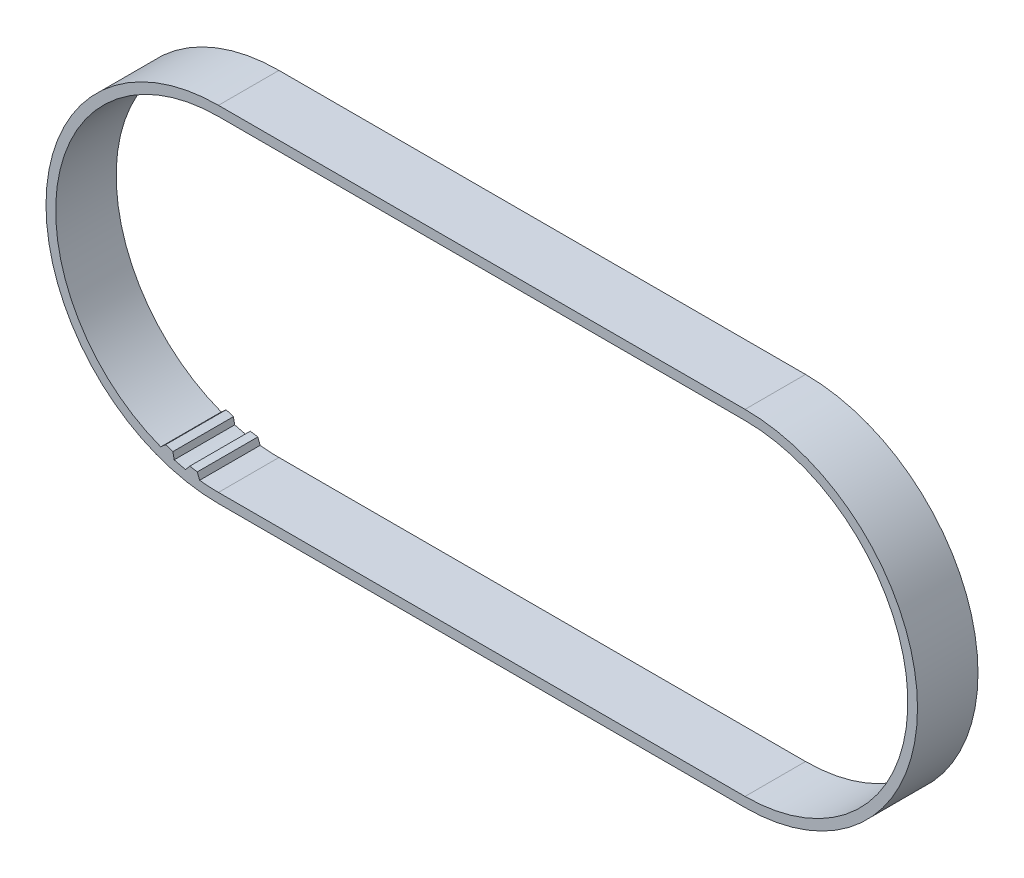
ISO-10303-21;
HEADER;
FILE_DESCRIPTION(('STEP AP214'),'2;1');
FILE_NAME('part.step','',(''),(''),'','','');
FILE_SCHEMA(('AUTOMOTIVE_DESIGN { 1 0 10303 214 1 1 1 1 }'));
ENDSEC;
DATA;
#1=APPLICATION_CONTEXT('core data for automotive mechanical design processes');
#2=APPLICATION_PROTOCOL_DEFINITION('international standard','automotive_design',2000,#1);
#3=PRODUCT_CONTEXT('',#1,'mechanical');
#4=PRODUCT('Part','Part','',(#3));
#5=PRODUCT_RELATED_PRODUCT_CATEGORY('part','',(#4));
#6=PRODUCT_DEFINITION_FORMATION('','',#4);
#7=PRODUCT_DEFINITION_CONTEXT('part definition',#1,'design');
#8=PRODUCT_DEFINITION('design','',#6,#7);
#9=PRODUCT_DEFINITION_SHAPE('','',#8);
#10=(LENGTH_UNIT() NAMED_UNIT(*) SI_UNIT(.MILLI.,.METRE.));
#11=(NAMED_UNIT(*) PLANE_ANGLE_UNIT() SI_UNIT($,.RADIAN.));
#12=(NAMED_UNIT(*) SI_UNIT($,.STERADIAN.) SOLID_ANGLE_UNIT());
#13=UNCERTAINTY_MEASURE_WITH_UNIT(LENGTH_MEASURE(1.E-05),#10,'distance_accuracy_value','');
#14=(GEOMETRIC_REPRESENTATION_CONTEXT(3) GLOBAL_UNCERTAINTY_ASSIGNED_CONTEXT((#13)) GLOBAL_UNIT_ASSIGNED_CONTEXT((#10,
#11,#12)) REPRESENTATION_CONTEXT('',''));
#15=CARTESIAN_POINT('',(0.,0.,0.));
#16=DIRECTION('',(0.,0.,1.));
#17=DIRECTION('',(1.,0.,0.));
#18=AXIS2_PLACEMENT_3D('',#15,#16,#17);
#19=CARTESIAN_POINT('',(-22.9836516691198,-12.1495819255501,2.38125));
#20=DIRECTION('',(-0.775674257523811,0.631133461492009,0.));
#21=DIRECTION('',(-0.631133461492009,-0.775674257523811,0.));
#22=AXIS2_PLACEMENT_3D('',#19,#20,#21);
#23=PLANE('',#22);
#24=DIRECTION('',(-0.631133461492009,-0.775674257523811,0.));
#25=VECTOR('',#24,1.);
#26=CARTESIAN_POINT('',(-22.9836516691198,-12.1495819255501,-2.38125));
#27=LINE('',#26,#25);
#28=CARTESIAN_POINT('',(-22.9836516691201,-12.1495819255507,-2.38125));
#29=VERTEX_POINT('',#28);
#30=CARTESIAN_POINT('',(-23.3100100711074,-12.5506822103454,-2.38125));
#31=VERTEX_POINT('',#30);
#32=EDGE_CURVE('E302',#29,#31,#27,.T.);
#33=ORIENTED_EDGE('',*,*,#32,.T.);
#34=DIRECTION('',(0.,0.,-1.));
#35=VECTOR('',#34,1.);
#36=CARTESIAN_POINT('',(-23.3100100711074,-12.5506822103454,-2.38125));
#37=LINE('',#36,#35);
#38=CARTESIAN_POINT('',(-23.3100100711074,-12.5506822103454,2.38125));
#39=VERTEX_POINT('',#38);
#40=EDGE_CURVE('E330',#31,#39,#37,.F.);
#41=ORIENTED_EDGE('',*,*,#40,.T.);
#42=DIRECTION('',(-0.631133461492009,-0.775674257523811,0.));
#43=VECTOR('',#42,1.);
#44=CARTESIAN_POINT('',(-22.9836516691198,-12.1495819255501,2.38125));
#45=LINE('',#44,#43);
#46=CARTESIAN_POINT('',(-22.9836516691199,-12.1495819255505,2.38125));
#47=VERTEX_POINT('',#46);
#48=EDGE_CURVE('E299',#39,#47,#45,.F.);
#49=ORIENTED_EDGE('',*,*,#48,.T.);
#50=DIRECTION('',(0.,0.,1.));
#51=VECTOR('',#50,1.);
#52=CARTESIAN_POINT('',(-22.98365166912,-12.1495819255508,2.38125));
#53=LINE('',#52,#51);
#54=EDGE_CURVE('E292',#29,#47,#53,.T.);
#55=ORIENTED_EDGE('',*,*,#54,.F.);
#56=EDGE_LOOP('',(#33,#41,#49,#55));
#57=FACE_BOUND('',#56,.T.);
#58=ADVANCED_FACE('F17',(#57),#23,.T.);
#59=CARTESIAN_POINT('',(-20.7264,0.,25.4));
#60=DIRECTION('',(0.,0.,-1.));
#61=DIRECTION('',(-1.,0.,0.));
#62=AXIS2_PLACEMENT_3D('',#59,#60,#61);
#63=CYLINDRICAL_SURFACE('',#62,12.81384661);
#64=ORIENTED_EDGE('',*,*,#40,.F.);
#65=CARTESIAN_POINT('',(-20.7264,0.,-2.38125));
#66=DIRECTION('',(0.,0.,-1.));
#67=DIRECTION('',(-1.,0.,0.));
#68=AXIS2_PLACEMENT_3D('',#65,#66,#67);
#69=CIRCLE('',#68,12.81384661);
#70=CARTESIAN_POINT('',(-24.2087517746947,-12.3315810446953,-2.38125));
#71=VERTEX_POINT('',#70);
#72=EDGE_CURVE('E306',#71,#31,#69,.F.);
#73=ORIENTED_EDGE('',*,*,#72,.F.);
#74=DIRECTION('',(0.,0.,-1.));
#75=VECTOR('',#74,1.);
#76=CARTESIAN_POINT('',(-24.2087517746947,-12.3315810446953,2.38125));
#77=LINE('',#76,#75);
#78=CARTESIAN_POINT('',(-24.2087517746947,-12.3315810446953,2.38125));
#79=VERTEX_POINT('',#78);
#80=EDGE_CURVE('E278',#79,#71,#77,.T.);
#81=ORIENTED_EDGE('',*,*,#80,.F.);
#82=CARTESIAN_POINT('',(-20.7264,0.,2.38125));
#83=DIRECTION('',(0.,0.,-1.));
#84=DIRECTION('',(-1.,0.,0.));
#85=AXIS2_PLACEMENT_3D('',#82,#83,#84);
#86=CIRCLE('',#85,12.81384661);
#87=EDGE_CURVE('E296',#39,#79,#86,.T.);
#88=ORIENTED_EDGE('',*,*,#87,.F.);
#89=EDGE_LOOP('',(#64,#73,#81,#88));
#90=FACE_BOUND('',#89,.T.);
#91=ADVANCED_FACE('F576',(#90),#63,.F.);
#92=CARTESIAN_POINT('',(-22.3912594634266,-12.2448262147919,2.38125));
#93=DIRECTION('',(0.158740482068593,0.987320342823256,0.));
#94=DIRECTION('',(-0.987320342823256,0.158740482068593,0.));
#95=AXIS2_PLACEMENT_3D('',#92,#93,#94);
#96=PLANE('',#95);
#97=ORIENTED_EDGE('',*,*,#54,.T.);
#98=DIRECTION('',(-0.987320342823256,0.158740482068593,0.));
#99=VECTOR('',#98,1.);
#100=CARTESIAN_POINT('',(-22.3912594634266,-12.2448262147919,2.38125));
#101=LINE('',#100,#99);
#102=CARTESIAN_POINT('',(-22.3912594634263,-12.2448262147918,2.38125));
#103=VERTEX_POINT('',#102);
#104=EDGE_CURVE('E287',#47,#103,#101,.F.);
#105=ORIENTED_EDGE('',*,*,#104,.T.);
#106=DIRECTION('',(0.,0.,1.));
#107=VECTOR('',#106,1.);
#108=CARTESIAN_POINT('',(-22.3912594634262,-12.2448262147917,2.38125));
#109=LINE('',#108,#107);
#110=CARTESIAN_POINT('',(-22.3912594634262,-12.2448262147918,-2.38125));
#111=VERTEX_POINT('',#110);
#112=EDGE_CURVE('E274',#111,#103,#109,.T.);
#113=ORIENTED_EDGE('',*,*,#112,.F.);
#114=DIRECTION('',(-0.987320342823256,0.158740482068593,0.));
#115=VECTOR('',#114,1.);
#116=CARTESIAN_POINT('',(-22.3912594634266,-12.2448262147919,-2.38125));
#117=LINE('',#116,#115);
#118=EDGE_CURVE('E293',#111,#29,#117,.T.);
#119=ORIENTED_EDGE('',*,*,#118,.T.);
#120=EDGE_LOOP('',(#97,#105,#113,#119));
#121=FACE_BOUND('',#120,.T.);
#122=ADVANCED_FACE('F568',(#121),#96,.T.);
#123=CARTESIAN_POINT('',(-24.2058921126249,-12.3453506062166,2.38125));
#124=DIRECTION('',(0.979107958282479,0.203341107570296,0.));
#125=DIRECTION('',(-0.203341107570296,0.979107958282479,0.));
#126=AXIS2_PLACEMENT_3D('',#123,#124,#125);
#127=PLANE('',#126);
#128=DIRECTION('',(-0.203341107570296,0.979107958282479,0.));
#129=VECTOR('',#128,1.);
#130=CARTESIAN_POINT('',(-24.2058921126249,-12.3453506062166,2.38125));
#131=LINE('',#130,#129);
#132=CARTESIAN_POINT('',(-24.3138992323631,-11.8252854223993,2.38125));
#133=VERTEX_POINT('',#132);
#134=EDGE_CURVE('E281',#133,#79,#131,.F.);
#135=ORIENTED_EDGE('',*,*,#134,.T.);
#136=ORIENTED_EDGE('',*,*,#80,.T.);
#137=DIRECTION('',(-0.203341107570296,0.979107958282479,0.));
#138=VECTOR('',#137,1.);
#139=CARTESIAN_POINT('',(-24.2058921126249,-12.3453506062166,-2.38125));
#140=LINE('',#139,#138);
#141=CARTESIAN_POINT('',(-24.3138992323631,-11.8252854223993,-2.38125));
#142=VERTEX_POINT('',#141);
#143=EDGE_CURVE('E284',#71,#142,#140,.T.);
#144=ORIENTED_EDGE('',*,*,#143,.T.);
#145=DIRECTION('',(0.,0.,1.));
#146=VECTOR('',#145,1.);
#147=CARTESIAN_POINT('',(-24.3138992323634,-11.8252854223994,2.38125));
#148=LINE('',#147,#146);
#149=EDGE_CURVE('E268',#133,#142,#148,.F.);
#150=ORIENTED_EDGE('',*,*,#149,.F.);
#151=EDGE_LOOP('',(#135,#136,#144,#150));
#152=FACE_BOUND('',#151,.T.);
#153=ADVANCED_FACE('F560',(#152),#127,.T.);
#154=CARTESIAN_POINT('',(-22.2020664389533,-12.7411520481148,2.38125));
#155=DIRECTION('',(0.934414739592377,0.356186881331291,0.));
#156=DIRECTION('',(-0.356186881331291,0.934414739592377,0.));
#157=AXIS2_PLACEMENT_3D('',#154,#155,#156);
#158=PLANE('',#157);
#159=ORIENTED_EDGE('',*,*,#112,.T.);
#160=DIRECTION('',(-0.356186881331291,0.934414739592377,0.));
#161=VECTOR('',#160,1.);
#162=CARTESIAN_POINT('',(-22.2020664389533,-12.7411520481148,2.38125));
#163=LINE('',#162,#161);
#164=CARTESIAN_POINT('',(-22.2070756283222,-12.7280110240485,2.38125));
#165=VERTEX_POINT('',#164);
#166=EDGE_CURVE('E272',#103,#165,#163,.F.);
#167=ORIENTED_EDGE('',*,*,#166,.T.);
#168=DIRECTION('',(0.,0.,-1.));
#169=VECTOR('',#168,1.);
#170=CARTESIAN_POINT('',(-22.2070756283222,-12.7280110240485,2.38125));
#171=LINE('',#170,#169);
#172=CARTESIAN_POINT('',(-22.2070756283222,-12.7280110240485,-2.38125));
#173=VERTEX_POINT('',#172);
#174=EDGE_CURVE('E271',#165,#173,#171,.T.);
#175=ORIENTED_EDGE('',*,*,#174,.T.);
#176=DIRECTION('',(-0.356186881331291,0.934414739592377,0.));
#177=VECTOR('',#176,1.);
#178=CARTESIAN_POINT('',(-22.2020664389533,-12.7411520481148,-2.38125));
#179=LINE('',#178,#177);
#180=EDGE_CURVE('E275',#173,#111,#179,.T.);
#181=ORIENTED_EDGE('',*,*,#180,.T.);
#182=EDGE_LOOP('',(#159,#167,#175,#181));
#183=FACE_BOUND('',#182,.T.);
#184=ADVANCED_FACE('F552',(#183),#158,.T.);
#185=CARTESIAN_POINT('',(-24.3138992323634,-11.8252854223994,2.38125));
#186=DIRECTION('',(0.313455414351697,0.94960291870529,0.));
#187=DIRECTION('',(-0.94960291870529,0.313455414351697,0.));
#188=AXIS2_PLACEMENT_3D('',#185,#186,#187);
#189=PLANE('',#188);
#190=DIRECTION('',(0.,0.,1.));
#191=VECTOR('',#190,1.);
#192=CARTESIAN_POINT('',(-24.8836609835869,-11.6372121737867,2.38125));
#193=LINE('',#192,#191);
#194=CARTESIAN_POINT('',(-24.883660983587,-11.6372121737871,2.38125));
#195=VERTEX_POINT('',#194);
#196=CARTESIAN_POINT('',(-24.883660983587,-11.6372121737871,-2.38125));
#197=VERTEX_POINT('',#196);
#198=EDGE_CURVE('E257',#195,#197,#193,.F.);
#199=ORIENTED_EDGE('',*,*,#198,.F.);
#200=DIRECTION('',(-0.94960291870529,0.313455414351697,0.));
#201=VECTOR('',#200,1.);
#202=CARTESIAN_POINT('',(-24.3138992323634,-11.8252854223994,2.38125));
#203=LINE('',#202,#201);
#204=EDGE_CURVE('E267',#195,#133,#203,.F.);
#205=ORIENTED_EDGE('',*,*,#204,.T.);
#206=ORIENTED_EDGE('',*,*,#149,.T.);
#207=DIRECTION('',(-0.94960291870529,0.313455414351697,0.));
#208=VECTOR('',#207,1.);
#209=CARTESIAN_POINT('',(-24.3138992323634,-11.8252854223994,-2.38125));
#210=LINE('',#209,#208);
#211=EDGE_CURVE('E264',#142,#197,#210,.T.);
#212=ORIENTED_EDGE('',*,*,#211,.T.);
#213=EDGE_LOOP('',(#199,#205,#206,#212));
#214=FACE_BOUND('',#213,.T.);
#215=ADVANCED_FACE('F544',(#214),#189,.T.);
#216=CARTESIAN_POINT('',(-20.7264,0.,25.4));
#217=DIRECTION('',(0.,0.,-1.));
#218=DIRECTION('',(-1.,0.,0.));
#219=AXIS2_PLACEMENT_3D('',#216,#217,#218);
#220=CYLINDRICAL_SURFACE('',#219,12.81384661);
#221=DIRECTION('',(0.,0.,1.));
#222=VECTOR('',#221,1.);
#223=CARTESIAN_POINT('',(-20.7264,-12.81384661,2.38125));
#224=LINE('',#223,#222);
#225=CARTESIAN_POINT('',(-20.7264,-12.81384661,-2.38125));
#226=VERTEX_POINT('',#225);
#227=CARTESIAN_POINT('',(-20.7264,-12.81384661,2.38125));
#228=VERTEX_POINT('',#227);
#229=EDGE_CURVE('E251',#226,#228,#224,.T.);
#230=ORIENTED_EDGE('',*,*,#229,.F.);
#231=CARTESIAN_POINT('',(-20.7264,0.,-2.38125));
#232=DIRECTION('',(0.,0.,-1.));
#233=DIRECTION('',(-1.,0.,0.));
#234=AXIS2_PLACEMENT_3D('',#231,#232,#233);
#235=CIRCLE('',#234,12.81384661);
#236=EDGE_CURVE('E323',#173,#226,#235,.F.);
#237=ORIENTED_EDGE('',*,*,#236,.F.);
#238=ORIENTED_EDGE('',*,*,#174,.F.);
#239=CARTESIAN_POINT('',(-20.7264,0.,2.38125));
#240=DIRECTION('',(0.,0.,-1.));
#241=DIRECTION('',(-1.,0.,0.));
#242=AXIS2_PLACEMENT_3D('',#239,#240,#241);
#243=CIRCLE('',#242,12.81384661);
#244=EDGE_CURVE('E261',#228,#165,#243,.T.);
#245=ORIENTED_EDGE('',*,*,#244,.F.);
#246=EDGE_LOOP('',(#230,#237,#238,#245));
#247=FACE_BOUND('',#246,.T.);
#248=ADVANCED_FACE('F536',(#247),#220,.F.);
#249=CARTESIAN_POINT('',(-24.8836609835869,-11.6372121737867,2.38125));
#250=DIRECTION('',(-0.665652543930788,0.746261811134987,0.));
#251=DIRECTION('',(-0.746261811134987,-0.665652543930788,0.));
#252=AXIS2_PLACEMENT_3D('',#249,#250,#251);
#253=PLANE('',#252);
#254=DIRECTION('',(-0.746261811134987,-0.665652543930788,0.));
#255=VECTOR('',#254,1.);
#256=CARTESIAN_POINT('',(-24.8836609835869,-11.6372121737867,-2.38125));
#257=LINE('',#256,#255);
#258=CARTESIAN_POINT('',(-25.2695519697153,-11.9814204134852,-2.38125));
#259=VERTEX_POINT('',#258);
#260=EDGE_CURVE('E254',#197,#259,#257,.T.);
#261=ORIENTED_EDGE('',*,*,#260,.T.);
#262=DIRECTION('',(0.,0.,-1.));
#263=VECTOR('',#262,1.);
#264=CARTESIAN_POINT('',(-25.2695518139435,-11.9814204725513,25.4));
#265=LINE('',#264,#263);
#266=CARTESIAN_POINT('',(-25.2695519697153,-11.9814204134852,2.38125));
#267=VERTEX_POINT('',#266);
#268=EDGE_CURVE('E244',#259,#267,#265,.F.);
#269=ORIENTED_EDGE('',*,*,#268,.T.);
#270=DIRECTION('',(-0.746261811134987,-0.665652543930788,0.));
#271=VECTOR('',#270,1.);
#272=CARTESIAN_POINT('',(-24.8836609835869,-11.6372121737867,2.38125));
#273=LINE('',#272,#271);
#274=EDGE_CURVE('E258',#267,#195,#273,.F.);
#275=ORIENTED_EDGE('',*,*,#274,.T.);
#276=ORIENTED_EDGE('',*,*,#198,.T.);
#277=EDGE_LOOP('',(#261,#269,#275,#276));
#278=FACE_BOUND('',#277,.T.);
#279=ADVANCED_FACE('F528',(#278),#253,.T.);
#280=CARTESIAN_POINT('',(20.7264,-12.81384661,2.38125));
#281=DIRECTION('',(0.,1.,0.));
#282=DIRECTION('',(0.,0.,1.));
#283=AXIS2_PLACEMENT_3D('',#280,#281,#282);
#284=PLANE('',#283);
#285=DIRECTION('',(1.,0.,0.));
#286=VECTOR('',#285,1.);
#287=CARTESIAN_POINT('',(-20.7264,-12.81384661,2.38125));
#288=LINE('',#287,#286);
#289=CARTESIAN_POINT('',(20.7264,-12.81384661,2.38125));
#290=VERTEX_POINT('',#289);
#291=EDGE_CURVE('E230',#290,#228,#288,.F.);
#292=ORIENTED_EDGE('',*,*,#291,.F.);
#293=DIRECTION('',(0.,0.,-1.));
#294=VECTOR('',#293,1.);
#295=CARTESIAN_POINT('',(20.7264,-12.81384661,25.4));
#296=LINE('',#295,#294);
#297=CARTESIAN_POINT('',(20.7264,-12.81384661,-2.38125));
#298=VERTEX_POINT('',#297);
#299=EDGE_CURVE('E249',#290,#298,#296,.T.);
#300=ORIENTED_EDGE('',*,*,#299,.T.);
#301=DIRECTION('',(-1.,0.,0.));
#302=VECTOR('',#301,1.);
#303=CARTESIAN_POINT('',(-20.7264,-12.81384661,-2.38125));
#304=LINE('',#303,#302);
#305=EDGE_CURVE('E211',#226,#298,#304,.F.);
#306=ORIENTED_EDGE('',*,*,#305,.F.);
#307=ORIENTED_EDGE('',*,*,#229,.T.);
#308=EDGE_LOOP('',(#292,#300,#306,#307));
#309=FACE_BOUND('',#308,.T.);
#310=ADVANCED_FACE('F520',(#309),#284,.T.);
#311=CARTESIAN_POINT('',(20.7264,0.,25.4));
#312=DIRECTION('',(0.,0.,-1.));
#313=DIRECTION('',(-1.,0.,0.));
#314=AXIS2_PLACEMENT_3D('',#311,#312,#313);
#315=CYLINDRICAL_SURFACE('',#314,12.81384661);
#316=ORIENTED_EDGE('',*,*,#299,.F.);
#317=CARTESIAN_POINT('',(20.7264,0.,2.38125));
#318=DIRECTION('',(0.,0.,-1.));
#319=DIRECTION('',(-1.,0.,0.));
#320=AXIS2_PLACEMENT_3D('',#317,#318,#319);
#321=CIRCLE('',#320,12.81384661);
#322=CARTESIAN_POINT('',(20.7264,12.81384661,2.38125));
#323=VERTEX_POINT('',#322);
#324=EDGE_CURVE('E233',#323,#290,#321,.T.);
#325=ORIENTED_EDGE('',*,*,#324,.F.);
#326=DIRECTION('',(0.,0.,-1.));
#327=VECTOR('',#326,1.);
#328=CARTESIAN_POINT('',(20.7264,12.81384661,2.38125));
#329=LINE('',#328,#327);
#330=CARTESIAN_POINT('',(20.7264,12.81384661,-2.38125));
#331=VERTEX_POINT('',#330);
#332=EDGE_CURVE('E247',#331,#323,#329,.F.);
#333=ORIENTED_EDGE('',*,*,#332,.F.);
#334=CARTESIAN_POINT('',(20.7264,0.,-2.38125));
#335=DIRECTION('',(0.,0.,-1.));
#336=DIRECTION('',(-1.,0.,0.));
#337=AXIS2_PLACEMENT_3D('',#334,#335,#336);
#338=CIRCLE('',#337,12.81384661);
#339=EDGE_CURVE('E210',#298,#331,#338,.F.);
#340=ORIENTED_EDGE('',*,*,#339,.F.);
#341=EDGE_LOOP('',(#316,#325,#333,#340));
#342=FACE_BOUND('',#341,.T.);
#343=ADVANCED_FACE('F512',(#342),#315,.F.);
#344=CARTESIAN_POINT('',(-20.7264,12.81384661,2.38125));
#345=DIRECTION('',(0.,-1.,0.));
#346=DIRECTION('',(0.,0.,-1.));
#347=AXIS2_PLACEMENT_3D('',#344,#345,#346);
#348=PLANE('',#347);
#349=DIRECTION('',(1.,0.,0.));
#350=VECTOR('',#349,1.);
#351=CARTESIAN_POINT('',(-20.7264,12.81384661,2.38125));
#352=LINE('',#351,#350);
#353=CARTESIAN_POINT('',(-20.7264,12.81384661,2.38125));
#354=VERTEX_POINT('',#353);
#355=EDGE_CURVE('E234',#354,#323,#352,.T.);
#356=ORIENTED_EDGE('',*,*,#355,.F.);
#357=DIRECTION('',(0.,0.,-1.));
#358=VECTOR('',#357,1.);
#359=CARTESIAN_POINT('',(-20.7264,12.81384661,25.4));
#360=LINE('',#359,#358);
#361=CARTESIAN_POINT('',(-20.7264,12.81384661,-2.38125));
#362=VERTEX_POINT('',#361);
#363=EDGE_CURVE('E242',#354,#362,#360,.T.);
#364=ORIENTED_EDGE('',*,*,#363,.T.);
#365=DIRECTION('',(-1.,0.,0.));
#366=VECTOR('',#365,1.);
#367=CARTESIAN_POINT('',(-20.7264,12.81384661,-2.38125));
#368=LINE('',#367,#366);
#369=EDGE_CURVE('E206',#331,#362,#368,.T.);
#370=ORIENTED_EDGE('',*,*,#369,.F.);
#371=ORIENTED_EDGE('',*,*,#332,.T.);
#372=EDGE_LOOP('',(#356,#364,#370,#371));
#373=FACE_BOUND('',#372,.T.);
#374=ADVANCED_FACE('F504',(#373),#348,.T.);
#375=CARTESIAN_POINT('',(-20.7264,0.,25.4));
#376=DIRECTION('',(0.,0.,-1.));
#377=DIRECTION('',(-1.,0.,0.));
#378=AXIS2_PLACEMENT_3D('',#375,#376,#377);
#379=CYLINDRICAL_SURFACE('',#378,12.81384661);
#380=ORIENTED_EDGE('',*,*,#363,.F.);
#381=CARTESIAN_POINT('',(-20.7264,0.,2.38125));
#382=DIRECTION('',(0.,0.,-1.));
#383=DIRECTION('',(-1.,0.,0.));
#384=AXIS2_PLACEMENT_3D('',#381,#382,#383);
#385=CIRCLE('',#384,12.81384661);
#386=EDGE_CURVE('E229',#267,#354,#385,.T.);
#387=ORIENTED_EDGE('',*,*,#386,.F.);
#388=ORIENTED_EDGE('',*,*,#268,.F.);
#389=CARTESIAN_POINT('',(-20.7264,0.,-2.38125));
#390=DIRECTION('',(0.,0.,-1.));
#391=DIRECTION('',(-1.,0.,0.));
#392=AXIS2_PLACEMENT_3D('',#389,#390,#391);
#393=CIRCLE('',#392,12.81384661);
#394=EDGE_CURVE('E209',#362,#259,#393,.F.);
#395=ORIENTED_EDGE('',*,*,#394,.F.);
#396=EDGE_LOOP('',(#380,#387,#388,#395));
#397=FACE_BOUND('',#396,.T.);
#398=ADVANCED_FACE('F496',(#397),#379,.F.);
#399=CARTESIAN_POINT('',(20.7264,0.,25.4));
#400=DIRECTION('',(0.,0.,-1.));
#401=DIRECTION('',(-1.,0.,0.));
#402=AXIS2_PLACEMENT_3D('',#399,#400,#401);
#403=CYLINDRICAL_SURFACE('',#402,13.57584661);
#404=CARTESIAN_POINT('',(20.7264,0.,-2.38125));
#405=DIRECTION('',(0.,0.,-1.));
#406=DIRECTION('',(-1.,0.,0.));
#407=AXIS2_PLACEMENT_3D('',#404,#405,#406);
#408=CIRCLE('',#407,13.57584661);
#409=CARTESIAN_POINT('',(20.7264,13.57584661,-2.38125));
#410=VERTEX_POINT('',#409);
#411=CARTESIAN_POINT('',(20.7264,-13.57584661,-2.38125));
#412=VERTEX_POINT('',#411);
#413=EDGE_CURVE('E214',#410,#412,#408,.T.);
#414=ORIENTED_EDGE('',*,*,#413,.F.);
#415=DIRECTION('',(0.,0.,1.));
#416=VECTOR('',#415,1.);
#417=CARTESIAN_POINT('',(20.7264,13.57584661,-2.38125));
#418=LINE('',#417,#416);
#419=CARTESIAN_POINT('',(20.7264,13.57584661,2.38125));
#420=VERTEX_POINT('',#419);
#421=EDGE_CURVE('E218',#420,#410,#418,.F.);
#422=ORIENTED_EDGE('',*,*,#421,.F.);
#423=CARTESIAN_POINT('',(20.7264,0.,2.38125));
#424=DIRECTION('',(0.,0.,-1.));
#425=DIRECTION('',(-1.,0.,0.));
#426=AXIS2_PLACEMENT_3D('',#423,#424,#425);
#427=CIRCLE('',#426,13.57584661);
#428=CARTESIAN_POINT('',(20.7264,-13.57584661,2.38125));
#429=VERTEX_POINT('',#428);
#430=EDGE_CURVE('E237',#429,#420,#427,.F.);
#431=ORIENTED_EDGE('',*,*,#430,.F.);
#432=DIRECTION('',(0.,0.,-1.));
#433=VECTOR('',#432,1.);
#434=CARTESIAN_POINT('',(20.7264,-13.57584661,-2.38125));
#435=LINE('',#434,#433);
#436=EDGE_CURVE('E224',#412,#429,#435,.F.);
#437=ORIENTED_EDGE('',*,*,#436,.F.);
#438=EDGE_LOOP('',(#414,#422,#431,#437));
#439=FACE_BOUND('',#438,.T.);
#440=ADVANCED_FACE('F488',(#439),#403,.T.);
#441=CARTESIAN_POINT('',(-20.7264,13.57584661,2.38125));
#442=DIRECTION('',(0.,0.,1.));
#443=DIRECTION('',(1.,0.,0.));
#444=AXIS2_PLACEMENT_3D('',#441,#442,#443);
#445=PLANE('',#444);
#446=ORIENTED_EDGE('',*,*,#274,.F.);
#447=ORIENTED_EDGE('',*,*,#386,.T.);
#448=ORIENTED_EDGE('',*,*,#355,.T.);
#449=ORIENTED_EDGE('',*,*,#324,.T.);
#450=ORIENTED_EDGE('',*,*,#291,.T.);
#451=ORIENTED_EDGE('',*,*,#244,.T.);
#452=ORIENTED_EDGE('',*,*,#166,.F.);
#453=ORIENTED_EDGE('',*,*,#104,.F.);
#454=ORIENTED_EDGE('',*,*,#48,.F.);
#455=ORIENTED_EDGE('',*,*,#87,.T.);
#456=ORIENTED_EDGE('',*,*,#134,.F.);
#457=ORIENTED_EDGE('',*,*,#204,.F.);
#458=EDGE_LOOP('',(#446,#447,#448,#449,#450,#451,#452,#453,#454,#455,#456,#457));
#459=FACE_BOUND('',#458,.T.);
#460=ORIENTED_EDGE('',*,*,#430,.T.);
#461=DIRECTION('',(1.,0.,0.));
#462=VECTOR('',#461,1.);
#463=CARTESIAN_POINT('',(-20.7264,13.57584661,2.38125));
#464=LINE('',#463,#462);
#465=CARTESIAN_POINT('',(-20.7264,13.57584661,2.38125));
#466=VERTEX_POINT('',#465);
#467=EDGE_CURVE('E226',#466,#420,#464,.T.);
#468=ORIENTED_EDGE('',*,*,#467,.F.);
#469=CARTESIAN_POINT('',(-20.7264,0.,2.38125));
#470=DIRECTION('',(0.,0.,-1.));
#471=DIRECTION('',(-1.,0.,0.));
#472=AXIS2_PLACEMENT_3D('',#469,#470,#471);
#473=CIRCLE('',#472,13.57584661);
#474=CARTESIAN_POINT('',(-20.7264,-13.57584661,2.38125));
#475=VERTEX_POINT('',#474);
#476=EDGE_CURVE('E221',#475,#466,#473,.T.);
#477=ORIENTED_EDGE('',*,*,#476,.F.);
#478=DIRECTION('',(1.,0.,0.));
#479=VECTOR('',#478,1.);
#480=CARTESIAN_POINT('',(20.7264,-13.57584661,2.38125));
#481=LINE('',#480,#479);
#482=EDGE_CURVE('E225',#429,#475,#481,.F.);
#483=ORIENTED_EDGE('',*,*,#482,.F.);
#484=EDGE_LOOP('',(#460,#468,#477,#483));
#485=FACE_BOUND('',#484,.T.);
#486=ADVANCED_FACE('F480',(#459,#485),#445,.T.);
#487=CARTESIAN_POINT('',(-20.7264,13.57584661,-2.38125));
#488=DIRECTION('',(0.,1.,0.));
#489=DIRECTION('',(0.,0.,1.));
#490=AXIS2_PLACEMENT_3D('',#487,#488,#489);
#491=PLANE('',#490);
#492=DIRECTION('',(-1.,0.,0.));
#493=VECTOR('',#492,1.);
#494=CARTESIAN_POINT('',(-20.7264,13.57584661,-2.38125));
#495=LINE('',#494,#493);
#496=CARTESIAN_POINT('',(-20.7264,13.57584661,-2.38125));
#497=VERTEX_POINT('',#496);
#498=EDGE_CURVE('E215',#497,#410,#495,.F.);
#499=ORIENTED_EDGE('',*,*,#498,.F.);
#500=DIRECTION('',(0.,0.,-1.));
#501=VECTOR('',#500,1.);
#502=CARTESIAN_POINT('',(-20.7264,13.57584661,25.4));
#503=LINE('',#502,#501);
#504=EDGE_CURVE('E219',#466,#497,#503,.T.);
#505=ORIENTED_EDGE('',*,*,#504,.F.);
#506=ORIENTED_EDGE('',*,*,#467,.T.);
#507=ORIENTED_EDGE('',*,*,#421,.T.);
#508=EDGE_LOOP('',(#499,#505,#506,#507));
#509=FACE_BOUND('',#508,.T.);
#510=ADVANCED_FACE('F472',(#509),#491,.T.);
#511=CARTESIAN_POINT('',(-20.7264,12.81384661,-2.38125));
#512=DIRECTION('',(0.,0.,-1.));
#513=DIRECTION('',(-1.,0.,0.));
#514=AXIS2_PLACEMENT_3D('',#511,#512,#513);
#515=PLANE('',#514);
#516=ORIENTED_EDGE('',*,*,#143,.F.);
#517=ORIENTED_EDGE('',*,*,#72,.T.);
#518=ORIENTED_EDGE('',*,*,#32,.F.);
#519=ORIENTED_EDGE('',*,*,#118,.F.);
#520=ORIENTED_EDGE('',*,*,#180,.F.);
#521=ORIENTED_EDGE('',*,*,#236,.T.);
#522=ORIENTED_EDGE('',*,*,#305,.T.);
#523=ORIENTED_EDGE('',*,*,#339,.T.);
#524=ORIENTED_EDGE('',*,*,#369,.T.);
#525=ORIENTED_EDGE('',*,*,#394,.T.);
#526=ORIENTED_EDGE('',*,*,#260,.F.);
#527=ORIENTED_EDGE('',*,*,#211,.F.);
#528=EDGE_LOOP('',(#516,#517,#518,#519,#520,#521,#522,#523,#524,#525,#526,#527));
#529=FACE_BOUND('',#528,.T.);
#530=DIRECTION('',(1.,0.,0.));
#531=VECTOR('',#530,1.);
#532=CARTESIAN_POINT('',(20.7264,-13.57584661,-2.38125));
#533=LINE('',#532,#531);
#534=CARTESIAN_POINT('',(-20.7264,-13.57584661,-2.38125));
#535=VERTEX_POINT('',#534);
#536=EDGE_CURVE('E35',#535,#412,#533,.T.);
#537=ORIENTED_EDGE('',*,*,#536,.F.);
#538=CARTESIAN_POINT('',(-20.7264,0.,-2.38125));
#539=DIRECTION('',(0.,0.,-1.));
#540=DIRECTION('',(-1.,0.,0.));
#541=AXIS2_PLACEMENT_3D('',#538,#539,#540);
#542=CIRCLE('',#541,13.57584661);
#543=EDGE_CURVE('E26',#497,#535,#542,.F.);
#544=ORIENTED_EDGE('',*,*,#543,.F.);
#545=ORIENTED_EDGE('',*,*,#498,.T.);
#546=ORIENTED_EDGE('',*,*,#413,.T.);
#547=EDGE_LOOP('',(#537,#544,#545,#546));
#548=FACE_BOUND('',#547,.T.);
#549=ADVANCED_FACE('F464',(#529,#548),#515,.T.);
#550=CARTESIAN_POINT('',(20.7264,-13.57584661,-2.38125));
#551=DIRECTION('',(0.,-1.,0.));
#552=DIRECTION('',(0.,0.,-1.));
#553=AXIS2_PLACEMENT_3D('',#550,#551,#552);
#554=PLANE('',#553);
#555=ORIENTED_EDGE('',*,*,#536,.T.);
#556=ORIENTED_EDGE('',*,*,#436,.T.);
#557=ORIENTED_EDGE('',*,*,#482,.T.);
#558=DIRECTION('',(0.,0.,-1.));
#559=VECTOR('',#558,1.);
#560=CARTESIAN_POINT('',(-20.7264,-13.57584661,25.4));
#561=LINE('',#560,#559);
#562=EDGE_CURVE('E10',#535,#475,#561,.F.);
#563=ORIENTED_EDGE('',*,*,#562,.F.);
#564=EDGE_LOOP('',(#555,#556,#557,#563));
#565=FACE_BOUND('',#564,.T.);
#566=ADVANCED_FACE('F456',(#565),#554,.T.);
#567=CARTESIAN_POINT('',(-20.7264,0.,25.4));
#568=DIRECTION('',(0.,0.,-1.));
#569=DIRECTION('',(-1.,0.,0.));
#570=AXIS2_PLACEMENT_3D('',#567,#568,#569);
#571=CYLINDRICAL_SURFACE('',#570,13.57584661);
#572=ORIENTED_EDGE('',*,*,#543,.T.);
#573=ORIENTED_EDGE('',*,*,#562,.T.);
#574=ORIENTED_EDGE('',*,*,#476,.T.);
#575=ORIENTED_EDGE('',*,*,#504,.T.);
#576=EDGE_LOOP('',(#572,#573,#574,#575));
#577=FACE_BOUND('',#576,.T.);
#578=ADVANCED_FACE('F452',(#577),#571,.T.);
#579=CLOSED_SHELL('',(#58,#91,#122,#153,#184,#215,#248,#279,#310,#343,#374,#398,#440,#486,#510,
#549,#566,#578));
#580=CARTESIAN_POINT('',(-20.7264,0.,25.4));
#581=DIRECTION('',(0.,0.,-1.));
#582=DIRECTION('',(-1.,0.,0.));
#583=AXIS2_PLACEMENT_3D('',#580,#581,#582);
#584=CYLINDRICAL_SURFACE('',#583,12.83924661);
#585=DIRECTION('',(0.,0.,1.));
#586=VECTOR('',#585,1.);
#587=CARTESIAN_POINT('',(-20.7264,12.83924661,-2.35585));
#588=LINE('',#587,#586);
#589=CARTESIAN_POINT('',(-20.7264,12.83924661,-2.35585));
#590=VERTEX_POINT('',#589);
#591=CARTESIAN_POINT('',(-20.7264,12.83924661,2.35585));
#592=VERTEX_POINT('',#591);
#593=EDGE_CURVE('E204',#590,#592,#588,.T.);
#594=ORIENTED_EDGE('',*,*,#593,.F.);
#595=CARTESIAN_POINT('',(-20.7264,0.,-2.35585));
#596=DIRECTION('',(0.,0.,-1.));
#597=DIRECTION('',(-1.,0.,0.));
#598=AXIS2_PLACEMENT_3D('',#595,#596,#597);
#599=CIRCLE('',#598,12.83924661);
#600=CARTESIAN_POINT('',(-20.7264,-12.83924661,-2.35585));
#601=VERTEX_POINT('',#600);
#602=EDGE_CURVE('E342',#601,#590,#599,.T.);
#603=ORIENTED_EDGE('',*,*,#602,.F.);
#604=DIRECTION('',(0.,0.,-1.));
#605=VECTOR('',#604,1.);
#606=CARTESIAN_POINT('',(-20.7264,-12.83924661,-2.35585));
#607=LINE('',#606,#605);
#608=CARTESIAN_POINT('',(-20.7264,-12.83924661,2.35585));
#609=VERTEX_POINT('',#608);
#610=EDGE_CURVE('E178',#609,#601,#607,.T.);
#611=ORIENTED_EDGE('',*,*,#610,.F.);
#612=CARTESIAN_POINT('',(-20.7264,0.,2.35585));
#613=DIRECTION('',(0.,0.,-1.));
#614=DIRECTION('',(-1.,0.,0.));
#615=AXIS2_PLACEMENT_3D('',#612,#613,#614);
#616=CIRCLE('',#615,12.83924661);
#617=EDGE_CURVE('E192',#592,#609,#616,.F.);
#618=ORIENTED_EDGE('',*,*,#617,.F.);
#619=EDGE_LOOP('',(#594,#603,#611,#618));
#620=FACE_BOUND('',#619,.T.);
#621=ADVANCED_FACE('F355',(#620),#584,.T.);
#622=CARTESIAN_POINT('',(-20.7264,12.83924661,-2.35585));
#623=DIRECTION('',(0.,1.,0.));
#624=DIRECTION('',(0.,0.,1.));
#625=AXIS2_PLACEMENT_3D('',#622,#623,#624);
#626=PLANE('',#625);
#627=DIRECTION('',(0.,0.,-1.));
#628=VECTOR('',#627,1.);
#629=CARTESIAN_POINT('',(20.7264,12.83924661,25.4));
#630=LINE('',#629,#628);
#631=CARTESIAN_POINT('',(20.7264,12.83924661,-2.35585));
#632=VERTEX_POINT('',#631);
#633=CARTESIAN_POINT('',(20.7264,12.83924661,2.35585));
#634=VERTEX_POINT('',#633);
#635=EDGE_CURVE('E201',#632,#634,#630,.F.);
#636=ORIENTED_EDGE('',*,*,#635,.F.);
#637=DIRECTION('',(1.,0.,0.));
#638=VECTOR('',#637,1.);
#639=CARTESIAN_POINT('',(-20.7264,12.83924661,-2.35585));
#640=LINE('',#639,#638);
#641=EDGE_CURVE('E341',#590,#632,#640,.T.);
#642=ORIENTED_EDGE('',*,*,#641,.F.);
#643=ORIENTED_EDGE('',*,*,#593,.T.);
#644=DIRECTION('',(-1.,0.,0.));
#645=VECTOR('',#644,1.);
#646=CARTESIAN_POINT('',(-20.7264,12.83924661,2.35585));
#647=LINE('',#646,#645);
#648=EDGE_CURVE('E177',#634,#592,#647,.T.);
#649=ORIENTED_EDGE('',*,*,#648,.F.);
#650=EDGE_LOOP('',(#636,#642,#643,#649));
#651=FACE_BOUND('',#650,.T.);
#652=ADVANCED_FACE('F366',(#651),#626,.T.);
#653=CARTESIAN_POINT('',(20.7264,0.,25.4));
#654=DIRECTION('',(0.,0.,-1.));
#655=DIRECTION('',(-1.,0.,0.));
#656=AXIS2_PLACEMENT_3D('',#653,#654,#655);
#657=CYLINDRICAL_SURFACE('',#656,12.83924661);
#658=DIRECTION('',(0.,0.,-1.));
#659=VECTOR('',#658,1.);
#660=CARTESIAN_POINT('',(20.7264,-12.83924661,-2.35585));
#661=LINE('',#660,#659);
#662=CARTESIAN_POINT('',(20.7264,-12.83924661,-2.35585));
#663=VERTEX_POINT('',#662);
#664=CARTESIAN_POINT('',(20.7264,-12.83924661,2.35585));
#665=VERTEX_POINT('',#664);
#666=EDGE_CURVE('E199',#663,#665,#661,.F.);
#667=ORIENTED_EDGE('',*,*,#666,.F.);
#668=CARTESIAN_POINT('',(20.7264,0.,-2.35585));
#669=DIRECTION('',(0.,0.,-1.));
#670=DIRECTION('',(-1.,0.,0.));
#671=AXIS2_PLACEMENT_3D('',#668,#669,#670);
#672=CIRCLE('',#671,12.83924661);
#673=EDGE_CURVE('E339',#632,#663,#672,.T.);
#674=ORIENTED_EDGE('',*,*,#673,.F.);
#675=ORIENTED_EDGE('',*,*,#635,.T.);
#676=CARTESIAN_POINT('',(20.7264,0.,2.35585));
#677=DIRECTION('',(0.,0.,-1.));
#678=DIRECTION('',(-1.,0.,0.));
#679=AXIS2_PLACEMENT_3D('',#676,#677,#678);
#680=CIRCLE('',#679,12.83924661);
#681=EDGE_CURVE('E168',#665,#634,#680,.F.);
#682=ORIENTED_EDGE('',*,*,#681,.F.);
#683=EDGE_LOOP('',(#667,#674,#675,#682));
#684=FACE_BOUND('',#683,.T.);
#685=ADVANCED_FACE('F363',(#684),#657,.T.);
#686=CARTESIAN_POINT('',(20.7264,-12.83924661,-2.35585));
#687=DIRECTION('',(0.,-1.,0.));
#688=DIRECTION('',(0.,0.,-1.));
#689=AXIS2_PLACEMENT_3D('',#686,#687,#688);
#690=PLANE('',#689);
#691=ORIENTED_EDGE('',*,*,#610,.T.);
#692=DIRECTION('',(1.,0.,0.));
#693=VECTOR('',#692,1.);
#694=CARTESIAN_POINT('',(-20.7264,-12.83924661,-2.35585));
#695=LINE('',#694,#693);
#696=EDGE_CURVE('E198',#663,#601,#695,.F.);
#697=ORIENTED_EDGE('',*,*,#696,.F.);
#698=ORIENTED_EDGE('',*,*,#666,.T.);
#699=DIRECTION('',(-1.,0.,0.));
#700=VECTOR('',#699,1.);
#701=CARTESIAN_POINT('',(-20.7264,-12.83924661,2.35585));
#702=LINE('',#701,#700);
#703=EDGE_CURVE('E189',#609,#665,#702,.F.);
#704=ORIENTED_EDGE('',*,*,#703,.F.);
#705=EDGE_LOOP('',(#691,#697,#698,#704));
#706=FACE_BOUND('',#705,.T.);
#707=ADVANCED_FACE('F359',(#706),#690,.T.);
#708=CARTESIAN_POINT('',(20.7264,0.,25.4));
#709=DIRECTION('',(0.,0.,-1.));
#710=DIRECTION('',(-1.,0.,0.));
#711=AXIS2_PLACEMENT_3D('',#708,#709,#710);
#712=CYLINDRICAL_SURFACE('',#711,13.55044661);
#713=CARTESIAN_POINT('',(20.7264,0.,-2.35585));
#714=DIRECTION('',(0.,0.,-1.));
#715=DIRECTION('',(-1.,0.,0.));
#716=AXIS2_PLACEMENT_3D('',#713,#714,#715);
#717=CIRCLE('',#716,13.55044661);
#718=CARTESIAN_POINT('',(20.7264,-13.55044661,-2.35585));
#719=VERTEX_POINT('',#718);
#720=CARTESIAN_POINT('',(20.7264,13.55044661,-2.35585));
#721=VERTEX_POINT('',#720);
#722=EDGE_CURVE('E183',#719,#721,#717,.F.);
#723=ORIENTED_EDGE('',*,*,#722,.F.);
#724=DIRECTION('',(0.,0.,1.));
#725=VECTOR('',#724,1.);
#726=CARTESIAN_POINT('',(20.7264,-13.55044661,2.35585));
#727=LINE('',#726,#725);
#728=CARTESIAN_POINT('',(20.7264,-13.55044661,2.35585));
#729=VERTEX_POINT('',#728);
#730=EDGE_CURVE('E173',#729,#719,#727,.F.);
#731=ORIENTED_EDGE('',*,*,#730,.F.);
#732=CARTESIAN_POINT('',(20.7264,0.,2.35585));
#733=DIRECTION('',(0.,0.,-1.));
#734=DIRECTION('',(-1.,0.,0.));
#735=AXIS2_PLACEMENT_3D('',#732,#733,#734);
#736=CIRCLE('',#735,13.55044661);
#737=CARTESIAN_POINT('',(20.7264,13.55044661,2.35585));
#738=VERTEX_POINT('',#737);
#739=EDGE_CURVE('E20',#738,#729,#736,.T.);
#740=ORIENTED_EDGE('',*,*,#739,.F.);
#741=DIRECTION('',(0.,0.,-1.));
#742=VECTOR('',#741,1.);
#743=CARTESIAN_POINT('',(20.7264,13.55044661,2.35585));
#744=LINE('',#743,#742);
#745=EDGE_CURVE('E157',#721,#738,#744,.F.);
#746=ORIENTED_EDGE('',*,*,#745,.F.);
#747=EDGE_LOOP('',(#723,#731,#740,#746));
#748=FACE_BOUND('',#747,.T.);
#749=ADVANCED_FACE('F172',(#748),#712,.F.);
#750=CARTESIAN_POINT('',(-20.7264,12.83924661,2.35585));
#751=DIRECTION('',(0.,0.,-1.));
#752=DIRECTION('',(-1.,0.,0.));
#753=AXIS2_PLACEMENT_3D('',#750,#751,#752);
#754=PLANE('',#753);
#755=ORIENTED_EDGE('',*,*,#703,.T.);
#756=ORIENTED_EDGE('',*,*,#681,.T.);
#757=ORIENTED_EDGE('',*,*,#648,.T.);
#758=ORIENTED_EDGE('',*,*,#617,.T.);
#759=EDGE_LOOP('',(#755,#756,#757,#758));
#760=FACE_BOUND('',#759,.T.);
#761=ORIENTED_EDGE('',*,*,#739,.T.);
#762=DIRECTION('',(1.,0.,0.));
#763=VECTOR('',#762,1.);
#764=CARTESIAN_POINT('',(20.7264,-13.55044661,2.35585));
#765=LINE('',#764,#763);
#766=CARTESIAN_POINT('',(-20.7264,-13.55044661,2.35585));
#767=VERTEX_POINT('',#766);
#768=EDGE_CURVE('E195',#767,#729,#765,.T.);
#769=ORIENTED_EDGE('',*,*,#768,.F.);
#770=CARTESIAN_POINT('',(-20.7264,0.,2.35585));
#771=DIRECTION('',(0.,0.,-1.));
#772=DIRECTION('',(-1.,0.,0.));
#773=AXIS2_PLACEMENT_3D('',#770,#771,#772);
#774=CIRCLE('',#773,13.55044661);
#775=CARTESIAN_POINT('',(-20.7264,13.55044661,2.35585));
#776=VERTEX_POINT('',#775);
#777=EDGE_CURVE('E181',#767,#776,#774,.T.);
#778=ORIENTED_EDGE('',*,*,#777,.T.);
#779=DIRECTION('',(1.,0.,0.));
#780=VECTOR('',#779,1.);
#781=CARTESIAN_POINT('',(-20.7264,13.55044661,2.35585));
#782=LINE('',#781,#780);
#783=EDGE_CURVE('E162',#738,#776,#782,.F.);
#784=ORIENTED_EDGE('',*,*,#783,.F.);
#785=EDGE_LOOP('',(#761,#769,#778,#784));
#786=FACE_BOUND('',#785,.T.);
#787=ADVANCED_FACE('F180',(#760,#786),#754,.T.);
#788=CARTESIAN_POINT('',(-20.7264,13.55044661,2.35585));
#789=DIRECTION('',(0.,-1.,0.));
#790=DIRECTION('',(0.,0.,-1.));
#791=AXIS2_PLACEMENT_3D('',#788,#789,#790);
#792=PLANE('',#791);
#793=ORIENTED_EDGE('',*,*,#745,.T.);
#794=ORIENTED_EDGE('',*,*,#783,.T.);
#795=DIRECTION('',(0.,0.,-1.));
#796=VECTOR('',#795,1.);
#797=CARTESIAN_POINT('',(-20.7264,13.55044661,25.4));
#798=LINE('',#797,#796);
#799=CARTESIAN_POINT('',(-20.7264,13.55044661,-2.35585));
#800=VERTEX_POINT('',#799);
#801=EDGE_CURVE('E337',#776,#800,#798,.T.);
#802=ORIENTED_EDGE('',*,*,#801,.T.);
#803=DIRECTION('',(1.,0.,0.));
#804=VECTOR('',#803,1.);
#805=CARTESIAN_POINT('',(-20.7264,13.55044661,-2.35585));
#806=LINE('',#805,#804);
#807=EDGE_CURVE('E164',#721,#800,#806,.F.);
#808=ORIENTED_EDGE('',*,*,#807,.F.);
#809=EDGE_LOOP('',(#793,#794,#802,#808));
#810=FACE_BOUND('',#809,.T.);
#811=ADVANCED_FACE('F159',(#810),#792,.T.);
#812=CARTESIAN_POINT('',(-20.7264,13.55044661,-2.35585));
#813=DIRECTION('',(0.,0.,1.));
#814=DIRECTION('',(1.,0.,0.));
#815=AXIS2_PLACEMENT_3D('',#812,#813,#814);
#816=PLANE('',#815);
#817=ORIENTED_EDGE('',*,*,#673,.T.);
#818=ORIENTED_EDGE('',*,*,#696,.T.);
#819=ORIENTED_EDGE('',*,*,#602,.T.);
#820=ORIENTED_EDGE('',*,*,#641,.T.);
#821=EDGE_LOOP('',(#817,#818,#819,#820));
#822=FACE_BOUND('',#821,.T.);
#823=DIRECTION('',(1.,0.,0.));
#824=VECTOR('',#823,1.);
#825=CARTESIAN_POINT('',(20.7264,-13.55044661,-2.35585));
#826=LINE('',#825,#824);
#827=CARTESIAN_POINT('',(-20.7264,-13.55044661,-2.35585));
#828=VERTEX_POINT('',#827);
#829=EDGE_CURVE('E187',#719,#828,#826,.F.);
#830=ORIENTED_EDGE('',*,*,#829,.F.);
#831=ORIENTED_EDGE('',*,*,#722,.T.);
#832=ORIENTED_EDGE('',*,*,#807,.T.);
#833=CARTESIAN_POINT('',(-20.7264,0.,-2.35585));
#834=DIRECTION('',(0.,0.,-1.));
#835=DIRECTION('',(-1.,0.,0.));
#836=AXIS2_PLACEMENT_3D('',#833,#834,#835);
#837=CIRCLE('',#836,13.55044661);
#838=EDGE_CURVE('E334',#800,#828,#837,.F.);
#839=ORIENTED_EDGE('',*,*,#838,.T.);
#840=EDGE_LOOP('',(#830,#831,#832,#839));
#841=FACE_BOUND('',#840,.T.);
#842=ADVANCED_FACE('F381',(#822,#841),#816,.T.);
#843=CARTESIAN_POINT('',(20.7264,-13.55044661,2.35585));
#844=DIRECTION('',(0.,1.,0.));
#845=DIRECTION('',(0.,0.,1.));
#846=AXIS2_PLACEMENT_3D('',#843,#844,#845);
#847=PLANE('',#846);
#848=DIRECTION('',(0.,0.,-1.));
#849=VECTOR('',#848,1.);
#850=CARTESIAN_POINT('',(-20.7264,-13.55044661,25.4));
#851=LINE('',#850,#849);
#852=EDGE_CURVE('E303',#828,#767,#851,.F.);
#853=ORIENTED_EDGE('',*,*,#852,.T.);
#854=ORIENTED_EDGE('',*,*,#768,.T.);
#855=ORIENTED_EDGE('',*,*,#730,.T.);
#856=ORIENTED_EDGE('',*,*,#829,.T.);
#857=EDGE_LOOP('',(#853,#854,#855,#856));
#858=FACE_BOUND('',#857,.T.);
#859=ADVANCED_FACE('F375',(#858),#847,.T.);
#860=CARTESIAN_POINT('',(-20.7264,0.,25.4));
#861=DIRECTION('',(0.,0.,-1.));
#862=DIRECTION('',(-1.,0.,0.));
#863=AXIS2_PLACEMENT_3D('',#860,#861,#862);
#864=CYLINDRICAL_SURFACE('',#863,13.55044661);
#865=ORIENTED_EDGE('',*,*,#838,.F.);
#866=ORIENTED_EDGE('',*,*,#801,.F.);
#867=ORIENTED_EDGE('',*,*,#777,.F.);
#868=ORIENTED_EDGE('',*,*,#852,.F.);
#869=EDGE_LOOP('',(#865,#866,#867,#868));
#870=FACE_BOUND('',#869,.T.);
#871=ADVANCED_FACE('F379',(#870),#864,.F.);
#872=CLOSED_SHELL('',(#621,#652,#685,#707,#749,#787,#811,#842,#859,#871));
#873=ORIENTED_CLOSED_SHELL('',*,#872,.T.);
#874=BREP_WITH_VOIDS('B1',#579,(#873));
#875=ADVANCED_BREP_SHAPE_REPRESENTATION('',(#18,#874),#14);
#876=SHAPE_DEFINITION_REPRESENTATION(#9,#875);
ENDSEC;
END-ISO-10303-21;
